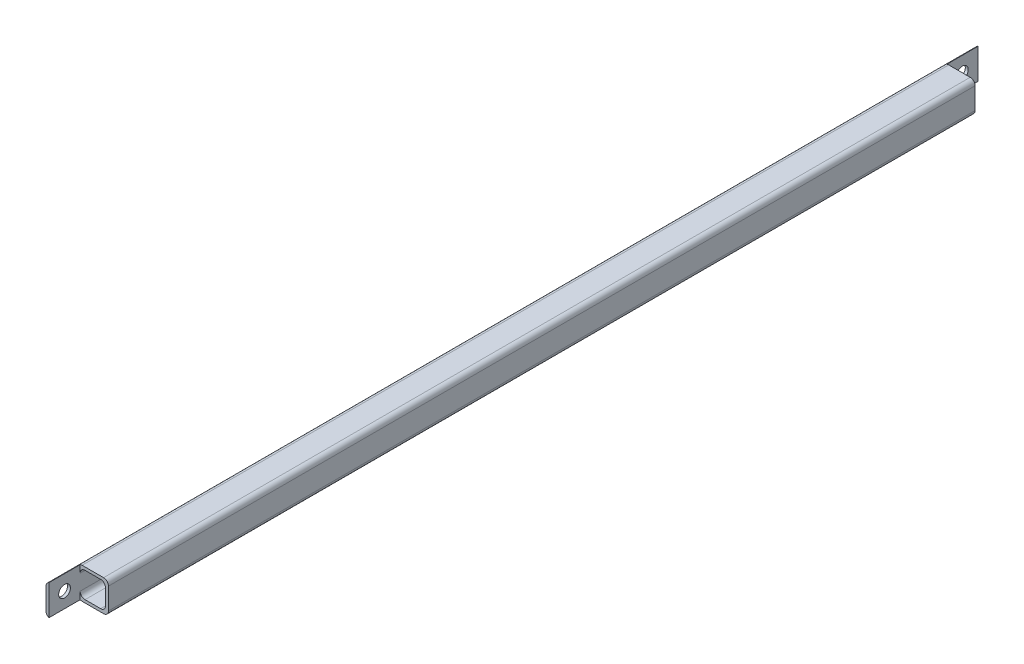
ISO-10303-21;
HEADER;
FILE_DESCRIPTION(('STEP AP214'),'2;1');
FILE_NAME('part.step','',(''),(''),'','','');
FILE_SCHEMA(('AUTOMOTIVE_DESIGN { 1 0 10303 214 1 1 1 1 }'));
ENDSEC;
DATA;
#1=APPLICATION_CONTEXT('core data for automotive mechanical design processes');
#2=APPLICATION_PROTOCOL_DEFINITION('international standard','automotive_design',2000,#1);
#3=PRODUCT_CONTEXT('',#1,'mechanical');
#4=PRODUCT('Part','Part','',(#3));
#5=PRODUCT_RELATED_PRODUCT_CATEGORY('part','',(#4));
#6=PRODUCT_DEFINITION_FORMATION('','',#4);
#7=PRODUCT_DEFINITION_CONTEXT('part definition',#1,'design');
#8=PRODUCT_DEFINITION('design','',#6,#7);
#9=PRODUCT_DEFINITION_SHAPE('','',#8);
#10=(LENGTH_UNIT() NAMED_UNIT(*) SI_UNIT(.MILLI.,.METRE.));
#11=(NAMED_UNIT(*) PLANE_ANGLE_UNIT() SI_UNIT($,.RADIAN.));
#12=(NAMED_UNIT(*) SI_UNIT($,.STERADIAN.) SOLID_ANGLE_UNIT());
#13=UNCERTAINTY_MEASURE_WITH_UNIT(LENGTH_MEASURE(1.E-05),#10,'distance_accuracy_value','');
#14=(GEOMETRIC_REPRESENTATION_CONTEXT(3) GLOBAL_UNCERTAINTY_ASSIGNED_CONTEXT((#13)) GLOBAL_UNIT_ASSIGNED_CONTEXT((#10,
#11,#12)) REPRESENTATION_CONTEXT('',''));
#15=CARTESIAN_POINT('',(0.,0.,0.));
#16=DIRECTION('',(0.,0.,1.));
#17=DIRECTION('',(1.,0.,0.));
#18=AXIS2_PLACEMENT_3D('',#15,#16,#17);
#19=CARTESIAN_POINT('',(-8.,5.5,238.));
#20=DIRECTION('',(1.,0.,0.));
#21=DIRECTION('',(0.,0.,-1.));
#22=AXIS2_PLACEMENT_3D('',#19,#20,#21);
#23=PLANE('',#22);
#24=DIRECTION('',(0.,-1.,0.));
#25=VECTOR('',#24,1.);
#26=CARTESIAN_POINT('',(-8.,5.5,-238.));
#27=LINE('',#26,#25);
#28=CARTESIAN_POINT('',(-8.,5.5,-238.));
#29=VERTEX_POINT('',#28);
#30=CARTESIAN_POINT('',(-8.,-5.5,-238.));
#31=VERTEX_POINT('',#30);
#32=EDGE_CURVE('E195',#29,#31,#27,.T.);
#33=ORIENTED_EDGE('',*,*,#32,.T.);
#34=DIRECTION('',(0.,0.,-1.));
#35=VECTOR('',#34,1.);
#36=CARTESIAN_POINT('',(-8.,-5.5,238.));
#37=LINE('',#36,#35);
#38=CARTESIAN_POINT('',(-8.,-5.5,238.));
#39=VERTEX_POINT('',#38);
#40=EDGE_CURVE('E212',#39,#31,#37,.T.);
#41=ORIENTED_EDGE('',*,*,#40,.F.);
#42=DIRECTION('',(0.,-1.,0.));
#43=VECTOR('',#42,1.);
#44=CARTESIAN_POINT('',(-8.,5.5,238.));
#45=LINE('',#44,#43);
#46=CARTESIAN_POINT('',(-8.,5.5,238.));
#47=VERTEX_POINT('',#46);
#48=EDGE_CURVE('E191',#47,#39,#45,.T.);
#49=ORIENTED_EDGE('',*,*,#48,.F.);
#50=DIRECTION('',(0.,0.,-1.));
#51=VECTOR('',#50,1.);
#52=CARTESIAN_POINT('',(-8.,5.5,238.));
#53=LINE('',#52,#51);
#54=EDGE_CURVE('E190',#47,#29,#53,.T.);
#55=ORIENTED_EDGE('',*,*,#54,.T.);
#56=EDGE_LOOP('',(#33,#41,#49,#55));
#57=FACE_BOUND('',#56,.T.);
#58=CARTESIAN_POINT('',(-8.,0.,-230.));
#59=DIRECTION('',(1.,0.,0.));
#60=DIRECTION('',(0.,0.,-1.));
#61=AXIS2_PLACEMENT_3D('',#58,#59,#60);
#62=CIRCLE('',#61,2.99999999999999);
#63=CARTESIAN_POINT('',(-8.,0.,-233.));
#64=VERTEX_POINT('',#63);
#65=EDGE_CURVE('E220',#64,#64,#62,.T.);
#66=ORIENTED_EDGE('',*,*,#65,.T.);
#67=EDGE_LOOP('',(#66));
#68=FACE_BOUND('',#67,.T.);
#69=CARTESIAN_POINT('',(-8.,0.,230.));
#70=DIRECTION('',(-1.,0.,0.));
#71=DIRECTION('',(0.,0.,1.));
#72=AXIS2_PLACEMENT_3D('',#69,#70,#71);
#73=CIRCLE('',#72,2.99999999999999);
#74=CARTESIAN_POINT('',(-8.,0.,233.));
#75=VERTEX_POINT('',#74);
#76=EDGE_CURVE('E230',#75,#75,#73,.T.);
#77=ORIENTED_EDGE('',*,*,#76,.F.);
#78=EDGE_LOOP('',(#77));
#79=FACE_BOUND('',#78,.T.);
#80=ADVANCED_FACE('F28',(#57,#68,#79),#23,.F.);
#81=CARTESIAN_POINT('',(-6.50000000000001,4.,238.));
#82=DIRECTION('',(1.,0.,0.));
#83=DIRECTION('',(0.,0.,-1.));
#84=AXIS2_PLACEMENT_3D('',#81,#82,#83);
#85=PLANE('',#84);
#86=DIRECTION('',(0.,0.,-1.));
#87=VECTOR('',#86,1.);
#88=CARTESIAN_POINT('',(-6.50000000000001,4.,238.));
#89=LINE('',#88,#87);
#90=CARTESIAN_POINT('',(-6.49999999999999,4.,222.));
#91=VERTEX_POINT('',#90);
#92=CARTESIAN_POINT('',(-6.50000000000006,4.,-222.));
#93=VERTEX_POINT('',#92);
#94=EDGE_CURVE('E324',#91,#93,#89,.T.);
#95=ORIENTED_EDGE('',*,*,#94,.F.);
#96=DIRECTION('',(0.,1.,0.));
#97=VECTOR('',#96,1.);
#98=CARTESIAN_POINT('',(-6.49999999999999,-8.,222.));
#99=LINE('',#98,#97);
#100=CARTESIAN_POINT('',(-6.49999999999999,7.79128784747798,222.));
#101=VERTEX_POINT('',#100);
#102=EDGE_CURVE('E182',#91,#101,#99,.T.);
#103=ORIENTED_EDGE('',*,*,#102,.T.);
#104=DIRECTION('',(0.,0.,-1.));
#105=VECTOR('',#104,1.);
#106=CARTESIAN_POINT('',(-6.49999999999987,7.79128784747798,238.));
#107=LINE('',#106,#105);
#108=CARTESIAN_POINT('',(-6.49999999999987,7.79128784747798,238.));
#109=VERTEX_POINT('',#108);
#110=EDGE_CURVE('E178',#101,#109,#107,.F.);
#111=ORIENTED_EDGE('',*,*,#110,.T.);
#112=DIRECTION('',(0.,-1.,0.));
#113=VECTOR('',#112,1.);
#114=CARTESIAN_POINT('',(-6.50000000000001,4.,238.));
#115=LINE('',#114,#113);
#116=CARTESIAN_POINT('',(-6.49999999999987,-7.79128784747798,238.));
#117=VERTEX_POINT('',#116);
#118=EDGE_CURVE('E45',#109,#117,#115,.T.);
#119=ORIENTED_EDGE('',*,*,#118,.T.);
#120=DIRECTION('',(0.,0.,-1.));
#121=VECTOR('',#120,1.);
#122=CARTESIAN_POINT('',(-6.49999999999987,-7.79128784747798,238.));
#123=LINE('',#122,#121);
#124=CARTESIAN_POINT('',(-6.49999999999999,-7.79128784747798,222.));
#125=VERTEX_POINT('',#124);
#126=EDGE_CURVE('E11',#125,#117,#123,.F.);
#127=ORIENTED_EDGE('',*,*,#126,.F.);
#128=CARTESIAN_POINT('',(-6.49999999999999,-4.,222.));
#129=VERTEX_POINT('',#128);
#130=EDGE_CURVE('E238',#125,#129,#99,.T.);
#131=ORIENTED_EDGE('',*,*,#130,.T.);
#132=DIRECTION('',(0.,0.,-1.));
#133=VECTOR('',#132,1.);
#134=CARTESIAN_POINT('',(-6.50000000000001,-4.,238.));
#135=LINE('',#134,#133);
#136=CARTESIAN_POINT('',(-6.50000000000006,-4.,-222.));
#137=VERTEX_POINT('',#136);
#138=EDGE_CURVE('E322',#129,#137,#135,.T.);
#139=ORIENTED_EDGE('',*,*,#138,.T.);
#140=DIRECTION('',(0.,1.,0.));
#141=VECTOR('',#140,1.);
#142=CARTESIAN_POINT('',(-6.50000000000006,-8.,-222.));
#143=LINE('',#142,#141);
#144=CARTESIAN_POINT('',(-6.50000000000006,-7.79128784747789,-222.));
#145=VERTEX_POINT('',#144);
#146=EDGE_CURVE('E274',#145,#137,#143,.T.);
#147=ORIENTED_EDGE('',*,*,#146,.F.);
#148=DIRECTION('',(0.,0.,-1.));
#149=VECTOR('',#148,1.);
#150=CARTESIAN_POINT('',(-6.5000000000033,-7.79128784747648,238.));
#151=LINE('',#150,#149);
#152=CARTESIAN_POINT('',(-6.49999999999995,-7.79128784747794,-238.));
#153=VERTEX_POINT('',#152);
#154=EDGE_CURVE('E305',#145,#153,#151,.T.);
#155=ORIENTED_EDGE('',*,*,#154,.T.);
#156=DIRECTION('',(0.,-1.,0.));
#157=VECTOR('',#156,1.);
#158=CARTESIAN_POINT('',(-6.50000000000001,4.,-238.));
#159=LINE('',#158,#157);
#160=CARTESIAN_POINT('',(-6.49999999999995,7.79128784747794,-238.));
#161=VERTEX_POINT('',#160);
#162=EDGE_CURVE('E174',#161,#153,#159,.T.);
#163=ORIENTED_EDGE('',*,*,#162,.F.);
#164=DIRECTION('',(0.,0.,-1.));
#165=VECTOR('',#164,1.);
#166=CARTESIAN_POINT('',(-6.5000000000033,7.79128784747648,238.));
#167=LINE('',#166,#165);
#168=CARTESIAN_POINT('',(-6.50000000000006,7.79128784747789,-222.));
#169=VERTEX_POINT('',#168);
#170=EDGE_CURVE('E308',#169,#161,#167,.T.);
#171=ORIENTED_EDGE('',*,*,#170,.F.);
#172=EDGE_CURVE('E269',#93,#169,#143,.T.);
#173=ORIENTED_EDGE('',*,*,#172,.F.);
#174=EDGE_LOOP('',(#95,#103,#111,#119,#127,#131,#139,#147,#155,#163,#171,#173));
#175=FACE_BOUND('',#174,.T.);
#176=CARTESIAN_POINT('',(-6.50000000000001,0.,-230.));
#177=DIRECTION('',(1.,0.,0.));
#178=DIRECTION('',(0.,0.,-1.));
#179=AXIS2_PLACEMENT_3D('',#176,#177,#178);
#180=CIRCLE('',#179,2.99999999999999);
#181=CARTESIAN_POINT('',(-6.50000000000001,0.,-233.));
#182=VERTEX_POINT('',#181);
#183=EDGE_CURVE('E217',#182,#182,#180,.T.);
#184=ORIENTED_EDGE('',*,*,#183,.F.);
#185=EDGE_LOOP('',(#184));
#186=FACE_BOUND('',#185,.T.);
#187=CARTESIAN_POINT('',(-6.50000000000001,0.,230.));
#188=DIRECTION('',(1.,0.,0.));
#189=DIRECTION('',(0.,0.,-1.));
#190=AXIS2_PLACEMENT_3D('',#187,#188,#189);
#191=CIRCLE('',#190,2.99999999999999);
#192=CARTESIAN_POINT('',(-6.50000000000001,0.,227.));
#193=VERTEX_POINT('',#192);
#194=EDGE_CURVE('E32',#193,#193,#191,.F.);
#195=ORIENTED_EDGE('',*,*,#194,.T.);
#196=EDGE_LOOP('',(#195));
#197=FACE_BOUND('',#196,.T.);
#198=ADVANCED_FACE('F180',(#175,#186,#197),#85,.T.);
#199=CARTESIAN_POINT('',(-5.5,5.5,238.));
#200=DIRECTION('',(0.,0.,1.));
#201=DIRECTION('',(1.,0.,0.));
#202=AXIS2_PLACEMENT_3D('',#199,#200,#201);
#203=PLANE('',#202);
#204=CARTESIAN_POINT('',(-5.5,-5.5,238.));
#205=DIRECTION('',(0.,0.,-1.));
#206=DIRECTION('',(-1.,0.,0.));
#207=AXIS2_PLACEMENT_3D('',#204,#205,#206);
#208=CIRCLE('',#207,2.5);
#209=EDGE_CURVE('E172',#117,#39,#208,.T.);
#210=ORIENTED_EDGE('',*,*,#209,.F.);
#211=ORIENTED_EDGE('',*,*,#118,.F.);
#212=CARTESIAN_POINT('',(-5.5,5.5,238.));
#213=DIRECTION('',(0.,0.,1.));
#214=DIRECTION('',(1.,0.,0.));
#215=AXIS2_PLACEMENT_3D('',#212,#213,#214);
#216=CIRCLE('',#215,2.5);
#217=EDGE_CURVE('E170',#109,#47,#216,.T.);
#218=ORIENTED_EDGE('',*,*,#217,.T.);
#219=ORIENTED_EDGE('',*,*,#48,.T.);
#220=EDGE_LOOP('',(#210,#211,#218,#219));
#221=FACE_BOUND('',#220,.T.);
#222=ADVANCED_FACE('F167',(#221),#203,.T.);
#223=CARTESIAN_POINT('',(5.49999999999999,-8.,238.));
#224=DIRECTION('',(0.,-1.,0.));
#225=DIRECTION('',(0.,0.,-1.));
#226=AXIS2_PLACEMENT_3D('',#223,#224,#225);
#227=PLANE('',#226);
#228=DIRECTION('',(-1.,0.,0.));
#229=VECTOR('',#228,1.);
#230=CARTESIAN_POINT('',(8.00000000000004,-8.,222.));
#231=LINE('',#230,#229);
#232=CARTESIAN_POINT('',(5.49999999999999,-8.,222.));
#233=VERTEX_POINT('',#232);
#234=CARTESIAN_POINT('',(-5.5,-8.,222.));
#235=VERTEX_POINT('',#234);
#236=EDGE_CURVE('E223',#233,#235,#231,.T.);
#237=ORIENTED_EDGE('',*,*,#236,.T.);
#238=DIRECTION('',(0.,0.,-1.));
#239=VECTOR('',#238,1.);
#240=CARTESIAN_POINT('',(-5.5,-8.,238.));
#241=LINE('',#240,#239);
#242=CARTESIAN_POINT('',(-5.5,-8.,-222.));
#243=VERTEX_POINT('',#242);
#244=EDGE_CURVE('E210',#235,#243,#241,.T.);
#245=ORIENTED_EDGE('',*,*,#244,.T.);
#246=DIRECTION('',(-1.,0.,0.));
#247=VECTOR('',#246,1.);
#248=CARTESIAN_POINT('',(7.99999999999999,-8.,-222.));
#249=LINE('',#248,#247);
#250=CARTESIAN_POINT('',(5.49999999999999,-8.,-222.));
#251=VERTEX_POINT('',#250);
#252=EDGE_CURVE('E266',#251,#243,#249,.T.);
#253=ORIENTED_EDGE('',*,*,#252,.F.);
#254=DIRECTION('',(0.,0.,-1.));
#255=VECTOR('',#254,1.);
#256=CARTESIAN_POINT('',(5.49999999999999,-8.,238.));
#257=LINE('',#256,#255);
#258=EDGE_CURVE('E208',#233,#251,#257,.T.);
#259=ORIENTED_EDGE('',*,*,#258,.F.);
#260=EDGE_LOOP('',(#237,#245,#253,#259));
#261=FACE_BOUND('',#260,.T.);
#262=ADVANCED_FACE('F399',(#261),#227,.T.);
#263=CARTESIAN_POINT('',(5.49999999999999,-5.5,238.));
#264=DIRECTION('',(0.,0.,-1.));
#265=DIRECTION('',(-1.,0.,0.));
#266=AXIS2_PLACEMENT_3D('',#263,#264,#265);
#267=CYLINDRICAL_SURFACE('',#266,2.5);
#268=CARTESIAN_POINT('',(5.49999999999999,-5.5,222.));
#269=DIRECTION('',(0.,0.,-1.));
#270=DIRECTION('',(-1.,0.,0.));
#271=AXIS2_PLACEMENT_3D('',#268,#269,#270);
#272=CIRCLE('',#271,2.5);
#273=CARTESIAN_POINT('',(8.00000000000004,-5.5,222.));
#274=VERTEX_POINT('',#273);
#275=EDGE_CURVE('E186',#233,#274,#272,.F.);
#276=ORIENTED_EDGE('',*,*,#275,.F.);
#277=ORIENTED_EDGE('',*,*,#258,.T.);
#278=CARTESIAN_POINT('',(5.49999999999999,-5.5,-222.));
#279=DIRECTION('',(0.,0.,-1.));
#280=DIRECTION('',(-1.,0.,0.));
#281=AXIS2_PLACEMENT_3D('',#278,#279,#280);
#282=CIRCLE('',#281,2.5);
#283=CARTESIAN_POINT('',(7.99999999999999,-5.5,-222.));
#284=VERTEX_POINT('',#283);
#285=EDGE_CURVE('E296',#251,#284,#282,.F.);
#286=ORIENTED_EDGE('',*,*,#285,.T.);
#287=DIRECTION('',(0.,0.,-1.));
#288=VECTOR('',#287,1.);
#289=CARTESIAN_POINT('',(7.99999999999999,-5.5,238.));
#290=LINE('',#289,#288);
#291=EDGE_CURVE('E206',#274,#284,#290,.T.);
#292=ORIENTED_EDGE('',*,*,#291,.F.);
#293=EDGE_LOOP('',(#276,#277,#286,#292));
#294=FACE_BOUND('',#293,.T.);
#295=ADVANCED_FACE('F396',(#294),#267,.T.);
#296=CARTESIAN_POINT('',(7.99999999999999,-5.5,238.));
#297=DIRECTION('',(-1.,0.,0.));
#298=DIRECTION('',(0.,0.,1.));
#299=AXIS2_PLACEMENT_3D('',#296,#297,#298);
#300=PLANE('',#299);
#301=DIRECTION('',(0.,0.,-1.));
#302=VECTOR('',#301,1.);
#303=CARTESIAN_POINT('',(7.99999999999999,5.5,238.));
#304=LINE('',#303,#302);
#305=CARTESIAN_POINT('',(8.00000000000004,5.5,222.));
#306=VERTEX_POINT('',#305);
#307=CARTESIAN_POINT('',(7.99999999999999,5.5,-222.));
#308=VERTEX_POINT('',#307);
#309=EDGE_CURVE('E204',#306,#308,#304,.T.);
#310=ORIENTED_EDGE('',*,*,#309,.F.);
#311=DIRECTION('',(0.,1.,0.));
#312=VECTOR('',#311,1.);
#313=CARTESIAN_POINT('',(8.00000000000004,-8.,222.));
#314=LINE('',#313,#312);
#315=EDGE_CURVE('E235',#274,#306,#314,.T.);
#316=ORIENTED_EDGE('',*,*,#315,.F.);
#317=ORIENTED_EDGE('',*,*,#291,.T.);
#318=DIRECTION('',(0.,1.,0.));
#319=VECTOR('',#318,1.);
#320=CARTESIAN_POINT('',(7.99999999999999,-8.,-222.));
#321=LINE('',#320,#319);
#322=EDGE_CURVE('E270',#284,#308,#321,.T.);
#323=ORIENTED_EDGE('',*,*,#322,.T.);
#324=EDGE_LOOP('',(#310,#316,#317,#323));
#325=FACE_BOUND('',#324,.T.);
#326=ADVANCED_FACE('F390',(#325),#300,.F.);
#327=CARTESIAN_POINT('',(5.49999999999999,5.5,238.));
#328=DIRECTION('',(0.,0.,-1.));
#329=DIRECTION('',(-1.,0.,0.));
#330=AXIS2_PLACEMENT_3D('',#327,#328,#329);
#331=CYLINDRICAL_SURFACE('',#330,2.5);
#332=DIRECTION('',(0.,0.,-1.));
#333=VECTOR('',#332,1.);
#334=CARTESIAN_POINT('',(5.49999999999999,8.,238.));
#335=LINE('',#334,#333);
#336=CARTESIAN_POINT('',(5.49999999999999,8.,222.));
#337=VERTEX_POINT('',#336);
#338=CARTESIAN_POINT('',(5.49999999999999,8.,-222.));
#339=VERTEX_POINT('',#338);
#340=EDGE_CURVE('E202',#337,#339,#335,.T.);
#341=ORIENTED_EDGE('',*,*,#340,.F.);
#342=CARTESIAN_POINT('',(5.49999999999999,5.5,222.));
#343=DIRECTION('',(0.,0.,-1.));
#344=DIRECTION('',(-1.,0.,0.));
#345=AXIS2_PLACEMENT_3D('',#342,#343,#344);
#346=CIRCLE('',#345,2.5);
#347=EDGE_CURVE('E260',#337,#306,#346,.T.);
#348=ORIENTED_EDGE('',*,*,#347,.T.);
#349=ORIENTED_EDGE('',*,*,#309,.T.);
#350=CARTESIAN_POINT('',(5.49999999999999,5.5,-222.));
#351=DIRECTION('',(0.,0.,-1.));
#352=DIRECTION('',(-1.,0.,0.));
#353=AXIS2_PLACEMENT_3D('',#350,#351,#352);
#354=CIRCLE('',#353,2.5);
#355=EDGE_CURVE('E293',#339,#308,#354,.T.);
#356=ORIENTED_EDGE('',*,*,#355,.F.);
#357=EDGE_LOOP('',(#341,#348,#349,#356));
#358=FACE_BOUND('',#357,.T.);
#359=ADVANCED_FACE('F386',(#358),#331,.T.);
#360=CARTESIAN_POINT('',(-5.5,8.,238.));
#361=DIRECTION('',(0.,1.,0.));
#362=DIRECTION('',(0.,0.,1.));
#363=AXIS2_PLACEMENT_3D('',#360,#361,#362);
#364=PLANE('',#363);
#365=DIRECTION('',(-1.,0.,0.));
#366=VECTOR('',#365,1.);
#367=CARTESIAN_POINT('',(8.00000000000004,8.,222.));
#368=LINE('',#367,#366);
#369=CARTESIAN_POINT('',(-5.5,8.,222.));
#370=VERTEX_POINT('',#369);
#371=EDGE_CURVE('E219',#337,#370,#368,.T.);
#372=ORIENTED_EDGE('',*,*,#371,.F.);
#373=ORIENTED_EDGE('',*,*,#340,.T.);
#374=DIRECTION('',(-1.,0.,0.));
#375=VECTOR('',#374,1.);
#376=CARTESIAN_POINT('',(7.99999999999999,8.,-222.));
#377=LINE('',#376,#375);
#378=CARTESIAN_POINT('',(-5.5,8.,-222.));
#379=VERTEX_POINT('',#378);
#380=EDGE_CURVE('E185',#339,#379,#377,.T.);
#381=ORIENTED_EDGE('',*,*,#380,.T.);
#382=DIRECTION('',(0.,0.,-1.));
#383=VECTOR('',#382,1.);
#384=CARTESIAN_POINT('',(-5.5,8.,238.));
#385=LINE('',#384,#383);
#386=EDGE_CURVE('E200',#370,#379,#385,.T.);
#387=ORIENTED_EDGE('',*,*,#386,.F.);
#388=EDGE_LOOP('',(#372,#373,#381,#387));
#389=FACE_BOUND('',#388,.T.);
#390=ADVANCED_FACE('F381',(#389),#364,.T.);
#391=CARTESIAN_POINT('',(-4.00000000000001,4.,238.));
#392=DIRECTION('',(0.,0.,-1.));
#393=DIRECTION('',(-1.,0.,0.));
#394=AXIS2_PLACEMENT_3D('',#391,#392,#393);
#395=CYLINDRICAL_SURFACE('',#394,2.5);
#396=CARTESIAN_POINT('',(-4.00000000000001,4.,222.));
#397=DIRECTION('',(0.,0.,-1.));
#398=DIRECTION('',(-1.,0.,0.));
#399=AXIS2_PLACEMENT_3D('',#396,#397,#398);
#400=CIRCLE('',#399,2.5);
#401=CARTESIAN_POINT('',(-4.00000000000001,6.5,222.));
#402=VERTEX_POINT('',#401);
#403=EDGE_CURVE('E258',#91,#402,#400,.T.);
#404=ORIENTED_EDGE('',*,*,#403,.F.);
#405=ORIENTED_EDGE('',*,*,#94,.T.);
#406=CARTESIAN_POINT('',(-4.00000000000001,4.,-222.));
#407=DIRECTION('',(0.,0.,-1.));
#408=DIRECTION('',(-1.,0.,0.));
#409=AXIS2_PLACEMENT_3D('',#406,#407,#408);
#410=CIRCLE('',#409,2.5);
#411=CARTESIAN_POINT('',(-4.00000000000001,6.5,-222.));
#412=VERTEX_POINT('',#411);
#413=EDGE_CURVE('E290',#93,#412,#410,.T.);
#414=ORIENTED_EDGE('',*,*,#413,.T.);
#415=DIRECTION('',(0.,0.,-1.));
#416=VECTOR('',#415,1.);
#417=CARTESIAN_POINT('',(-4.00000000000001,6.5,238.));
#418=LINE('',#417,#416);
#419=EDGE_CURVE('E173',#402,#412,#418,.T.);
#420=ORIENTED_EDGE('',*,*,#419,.F.);
#421=EDGE_LOOP('',(#404,#405,#414,#420));
#422=FACE_BOUND('',#421,.T.);
#423=ADVANCED_FACE('F375',(#422),#395,.F.);
#424=CARTESIAN_POINT('',(-4.00000000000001,-4.,238.));
#425=DIRECTION('',(0.,0.,-1.));
#426=DIRECTION('',(-1.,0.,0.));
#427=AXIS2_PLACEMENT_3D('',#424,#425,#426);
#428=CYLINDRICAL_SURFACE('',#427,2.5);
#429=CARTESIAN_POINT('',(-4.00000000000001,-4.,222.));
#430=DIRECTION('',(0.,0.,-1.));
#431=DIRECTION('',(-1.,0.,0.));
#432=AXIS2_PLACEMENT_3D('',#429,#430,#431);
#433=CIRCLE('',#432,2.5);
#434=CARTESIAN_POINT('',(-4.00000000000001,-6.5,222.));
#435=VERTEX_POINT('',#434);
#436=EDGE_CURVE('E256',#435,#129,#433,.T.);
#437=ORIENTED_EDGE('',*,*,#436,.F.);
#438=DIRECTION('',(0.,0.,-1.));
#439=VECTOR('',#438,1.);
#440=CARTESIAN_POINT('',(-4.00000000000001,-6.5,238.));
#441=LINE('',#440,#439);
#442=CARTESIAN_POINT('',(-4.00000000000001,-6.5,-222.));
#443=VERTEX_POINT('',#442);
#444=EDGE_CURVE('E320',#435,#443,#441,.T.);
#445=ORIENTED_EDGE('',*,*,#444,.T.);
#446=CARTESIAN_POINT('',(-4.00000000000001,-4.,-222.));
#447=DIRECTION('',(0.,0.,-1.));
#448=DIRECTION('',(-1.,0.,0.));
#449=AXIS2_PLACEMENT_3D('',#446,#447,#448);
#450=CIRCLE('',#449,2.5);
#451=EDGE_CURVE('E287',#443,#137,#450,.T.);
#452=ORIENTED_EDGE('',*,*,#451,.T.);
#453=ORIENTED_EDGE('',*,*,#138,.F.);
#454=EDGE_LOOP('',(#437,#445,#452,#453));
#455=FACE_BOUND('',#454,.T.);
#456=ADVANCED_FACE('F348',(#455),#428,.F.);
#457=CARTESIAN_POINT('',(3.99999999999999,-6.5,238.));
#458=DIRECTION('',(0.,-1.,0.));
#459=DIRECTION('',(0.,0.,-1.));
#460=AXIS2_PLACEMENT_3D('',#457,#458,#459);
#461=PLANE('',#460);
#462=ORIENTED_EDGE('',*,*,#444,.F.);
#463=DIRECTION('',(1.,0.,0.));
#464=VECTOR('',#463,1.);
#465=CARTESIAN_POINT('',(3.99999999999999,-6.5,222.));
#466=LINE('',#465,#464);
#467=CARTESIAN_POINT('',(3.99999999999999,-6.5,222.));
#468=VERTEX_POINT('',#467);
#469=EDGE_CURVE('E253',#435,#468,#466,.T.);
#470=ORIENTED_EDGE('',*,*,#469,.T.);
#471=DIRECTION('',(0.,0.,-1.));
#472=VECTOR('',#471,1.);
#473=CARTESIAN_POINT('',(3.99999999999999,-6.5,238.));
#474=LINE('',#473,#472);
#475=CARTESIAN_POINT('',(3.99999999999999,-6.5,-222.));
#476=VERTEX_POINT('',#475);
#477=EDGE_CURVE('E318',#468,#476,#474,.T.);
#478=ORIENTED_EDGE('',*,*,#477,.T.);
#479=DIRECTION('',(1.,0.,0.));
#480=VECTOR('',#479,1.);
#481=CARTESIAN_POINT('',(3.99999999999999,-6.5,-222.));
#482=LINE('',#481,#480);
#483=EDGE_CURVE('E284',#443,#476,#482,.T.);
#484=ORIENTED_EDGE('',*,*,#483,.F.);
#485=EDGE_LOOP('',(#462,#470,#478,#484));
#486=FACE_BOUND('',#485,.T.);
#487=ADVANCED_FACE('F352',(#486),#461,.F.);
#488=CARTESIAN_POINT('',(3.99999999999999,-4.,238.));
#489=DIRECTION('',(0.,0.,-1.));
#490=DIRECTION('',(-1.,0.,0.));
#491=AXIS2_PLACEMENT_3D('',#488,#489,#490);
#492=CYLINDRICAL_SURFACE('',#491,2.5);
#493=ORIENTED_EDGE('',*,*,#477,.F.);
#494=CARTESIAN_POINT('',(3.99999999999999,-4.,222.));
#495=DIRECTION('',(0.,0.,-1.));
#496=DIRECTION('',(-1.,0.,0.));
#497=AXIS2_PLACEMENT_3D('',#494,#495,#496);
#498=CIRCLE('',#497,2.5);
#499=CARTESIAN_POINT('',(6.49999999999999,-4.,222.));
#500=VERTEX_POINT('',#499);
#501=EDGE_CURVE('E250',#468,#500,#498,.F.);
#502=ORIENTED_EDGE('',*,*,#501,.T.);
#503=DIRECTION('',(0.,0.,-1.));
#504=VECTOR('',#503,1.);
#505=CARTESIAN_POINT('',(6.49999999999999,-4.,238.));
#506=LINE('',#505,#504);
#507=CARTESIAN_POINT('',(6.49999999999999,-4.,-222.));
#508=VERTEX_POINT('',#507);
#509=EDGE_CURVE('E316',#500,#508,#506,.T.);
#510=ORIENTED_EDGE('',*,*,#509,.T.);
#511=CARTESIAN_POINT('',(3.99999999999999,-4.,-222.));
#512=DIRECTION('',(0.,0.,-1.));
#513=DIRECTION('',(-1.,0.,0.));
#514=AXIS2_PLACEMENT_3D('',#511,#512,#513);
#515=CIRCLE('',#514,2.5);
#516=EDGE_CURVE('E281',#476,#508,#515,.F.);
#517=ORIENTED_EDGE('',*,*,#516,.F.);
#518=EDGE_LOOP('',(#493,#502,#510,#517));
#519=FACE_BOUND('',#518,.T.);
#520=ADVANCED_FACE('F360',(#519),#492,.F.);
#521=CARTESIAN_POINT('',(6.49999999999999,-4.,238.));
#522=DIRECTION('',(-1.,0.,0.));
#523=DIRECTION('',(0.,0.,1.));
#524=AXIS2_PLACEMENT_3D('',#521,#522,#523);
#525=PLANE('',#524);
#526=DIRECTION('',(0.,-1.,0.));
#527=VECTOR('',#526,1.);
#528=CARTESIAN_POINT('',(6.49999999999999,-4.,222.));
#529=LINE('',#528,#527);
#530=CARTESIAN_POINT('',(6.49999999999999,4.,222.));
#531=VERTEX_POINT('',#530);
#532=EDGE_CURVE('E248',#531,#500,#529,.T.);
#533=ORIENTED_EDGE('',*,*,#532,.F.);
#534=DIRECTION('',(0.,0.,-1.));
#535=VECTOR('',#534,1.);
#536=CARTESIAN_POINT('',(6.49999999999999,4.,238.));
#537=LINE('',#536,#535);
#538=CARTESIAN_POINT('',(6.49999999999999,4.,-222.));
#539=VERTEX_POINT('',#538);
#540=EDGE_CURVE('E314',#531,#539,#537,.T.);
#541=ORIENTED_EDGE('',*,*,#540,.T.);
#542=DIRECTION('',(0.,-1.,0.));
#543=VECTOR('',#542,1.);
#544=CARTESIAN_POINT('',(6.49999999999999,-4.,-222.));
#545=LINE('',#544,#543);
#546=EDGE_CURVE('E278',#539,#508,#545,.T.);
#547=ORIENTED_EDGE('',*,*,#546,.T.);
#548=ORIENTED_EDGE('',*,*,#509,.F.);
#549=EDGE_LOOP('',(#533,#541,#547,#548));
#550=FACE_BOUND('',#549,.T.);
#551=ADVANCED_FACE('F364',(#550),#525,.T.);
#552=CARTESIAN_POINT('',(3.99999999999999,4.,238.));
#553=DIRECTION('',(0.,0.,-1.));
#554=DIRECTION('',(-1.,0.,0.));
#555=AXIS2_PLACEMENT_3D('',#552,#553,#554);
#556=CYLINDRICAL_SURFACE('',#555,2.5);
#557=CARTESIAN_POINT('',(3.99999999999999,4.,222.));
#558=DIRECTION('',(0.,0.,-1.));
#559=DIRECTION('',(-1.,0.,0.));
#560=AXIS2_PLACEMENT_3D('',#557,#558,#559);
#561=CIRCLE('',#560,2.5);
#562=CARTESIAN_POINT('',(3.99999999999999,6.5,222.));
#563=VERTEX_POINT('',#562);
#564=EDGE_CURVE('E246',#563,#531,#561,.T.);
#565=ORIENTED_EDGE('',*,*,#564,.F.);
#566=DIRECTION('',(0.,0.,-1.));
#567=VECTOR('',#566,1.);
#568=CARTESIAN_POINT('',(3.99999999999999,6.5,238.));
#569=LINE('',#568,#567);
#570=CARTESIAN_POINT('',(3.99999999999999,6.5,-222.));
#571=VERTEX_POINT('',#570);
#572=EDGE_CURVE('E52',#563,#571,#569,.T.);
#573=ORIENTED_EDGE('',*,*,#572,.T.);
#574=CARTESIAN_POINT('',(3.99999999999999,4.,-222.));
#575=DIRECTION('',(0.,0.,-1.));
#576=DIRECTION('',(-1.,0.,0.));
#577=AXIS2_PLACEMENT_3D('',#574,#575,#576);
#578=CIRCLE('',#577,2.5);
#579=EDGE_CURVE('E273',#571,#539,#578,.T.);
#580=ORIENTED_EDGE('',*,*,#579,.T.);
#581=ORIENTED_EDGE('',*,*,#540,.F.);
#582=EDGE_LOOP('',(#565,#573,#580,#581));
#583=FACE_BOUND('',#582,.T.);
#584=ADVANCED_FACE('F367',(#583),#556,.F.);
#585=CARTESIAN_POINT('',(-4.00000000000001,6.5,238.));
#586=DIRECTION('',(0.,1.,0.));
#587=DIRECTION('',(0.,0.,1.));
#588=AXIS2_PLACEMENT_3D('',#585,#586,#587);
#589=PLANE('',#588);
#590=ORIENTED_EDGE('',*,*,#572,.F.);
#591=DIRECTION('',(-1.,0.,0.));
#592=VECTOR('',#591,1.);
#593=CARTESIAN_POINT('',(-4.00000000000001,6.5,222.));
#594=LINE('',#593,#592);
#595=EDGE_CURVE('E243',#563,#402,#594,.T.);
#596=ORIENTED_EDGE('',*,*,#595,.T.);
#597=ORIENTED_EDGE('',*,*,#419,.T.);
#598=DIRECTION('',(-1.,0.,0.));
#599=VECTOR('',#598,1.);
#600=CARTESIAN_POINT('',(-4.00000000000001,6.5,-222.));
#601=LINE('',#600,#599);
#602=EDGE_CURVE('E37',#571,#412,#601,.T.);
#603=ORIENTED_EDGE('',*,*,#602,.F.);
#604=EDGE_LOOP('',(#590,#596,#597,#603));
#605=FACE_BOUND('',#604,.T.);
#606=ADVANCED_FACE('F369',(#605),#589,.F.);
#607=CARTESIAN_POINT('',(-5.5,5.5,-238.));
#608=DIRECTION('',(0.,0.,1.));
#609=DIRECTION('',(1.,0.,0.));
#610=AXIS2_PLACEMENT_3D('',#607,#608,#609);
#611=PLANE('',#610);
#612=CARTESIAN_POINT('',(-5.5,5.5,-238.));
#613=DIRECTION('',(0.,0.,1.));
#614=DIRECTION('',(1.,0.,0.));
#615=AXIS2_PLACEMENT_3D('',#612,#613,#614);
#616=CIRCLE('',#615,2.5);
#617=EDGE_CURVE('E326',#161,#29,#616,.T.);
#618=ORIENTED_EDGE('',*,*,#617,.F.);
#619=ORIENTED_EDGE('',*,*,#162,.T.);
#620=CARTESIAN_POINT('',(-5.5,-5.5,-238.));
#621=DIRECTION('',(0.,0.,-1.));
#622=DIRECTION('',(-1.,0.,0.));
#623=AXIS2_PLACEMENT_3D('',#620,#621,#622);
#624=CIRCLE('',#623,2.5);
#625=EDGE_CURVE('E192',#153,#31,#624,.T.);
#626=ORIENTED_EDGE('',*,*,#625,.T.);
#627=ORIENTED_EDGE('',*,*,#32,.F.);
#628=EDGE_LOOP('',(#618,#619,#626,#627));
#629=FACE_BOUND('',#628,.T.);
#630=ADVANCED_FACE('F333',(#629),#611,.F.);
#631=CARTESIAN_POINT('',(-5.5,5.5,238.));
#632=DIRECTION('',(0.,0.,-1.));
#633=DIRECTION('',(-1.,0.,0.));
#634=AXIS2_PLACEMENT_3D('',#631,#632,#633);
#635=CYLINDRICAL_SURFACE('',#634,2.5);
#636=ORIENTED_EDGE('',*,*,#110,.F.);
#637=CARTESIAN_POINT('',(-5.5,5.5,222.));
#638=DIRECTION('',(0.,0.,-1.));
#639=DIRECTION('',(-1.,0.,0.));
#640=AXIS2_PLACEMENT_3D('',#637,#638,#639);
#641=CIRCLE('',#640,2.5);
#642=EDGE_CURVE('E241',#101,#370,#641,.T.);
#643=ORIENTED_EDGE('',*,*,#642,.T.);
#644=ORIENTED_EDGE('',*,*,#386,.T.);
#645=CARTESIAN_POINT('',(-5.5,5.5,-222.));
#646=DIRECTION('',(0.,0.,-1.));
#647=DIRECTION('',(-1.,0.,0.));
#648=AXIS2_PLACEMENT_3D('',#645,#646,#647);
#649=CIRCLE('',#648,2.5);
#650=EDGE_CURVE('E302',#169,#379,#649,.T.);
#651=ORIENTED_EDGE('',*,*,#650,.F.);
#652=ORIENTED_EDGE('',*,*,#170,.T.);
#653=ORIENTED_EDGE('',*,*,#617,.T.);
#654=ORIENTED_EDGE('',*,*,#54,.F.);
#655=ORIENTED_EDGE('',*,*,#217,.F.);
#656=EDGE_LOOP('',(#636,#643,#644,#651,#652,#653,#654,#655));
#657=FACE_BOUND('',#656,.T.);
#658=ADVANCED_FACE('F30',(#657),#635,.T.);
#659=CARTESIAN_POINT('',(-5.5,-5.5,238.));
#660=DIRECTION('',(0.,0.,-1.));
#661=DIRECTION('',(-1.,0.,0.));
#662=AXIS2_PLACEMENT_3D('',#659,#660,#661);
#663=CYLINDRICAL_SURFACE('',#662,2.5);
#664=CARTESIAN_POINT('',(-5.5,-5.5,222.));
#665=DIRECTION('',(0.,0.,-1.));
#666=DIRECTION('',(-1.,0.,0.));
#667=AXIS2_PLACEMENT_3D('',#664,#665,#666);
#668=CIRCLE('',#667,2.5);
#669=EDGE_CURVE('E237',#125,#235,#668,.F.);
#670=ORIENTED_EDGE('',*,*,#669,.F.);
#671=ORIENTED_EDGE('',*,*,#126,.T.);
#672=ORIENTED_EDGE('',*,*,#209,.T.);
#673=ORIENTED_EDGE('',*,*,#40,.T.);
#674=ORIENTED_EDGE('',*,*,#625,.F.);
#675=ORIENTED_EDGE('',*,*,#154,.F.);
#676=CARTESIAN_POINT('',(-5.5,-5.5,-222.));
#677=DIRECTION('',(0.,0.,-1.));
#678=DIRECTION('',(-1.,0.,0.));
#679=AXIS2_PLACEMENT_3D('',#676,#677,#678);
#680=CIRCLE('',#679,2.5);
#681=EDGE_CURVE('E299',#145,#243,#680,.F.);
#682=ORIENTED_EDGE('',*,*,#681,.T.);
#683=ORIENTED_EDGE('',*,*,#244,.F.);
#684=EDGE_LOOP('',(#670,#671,#672,#673,#674,#675,#682,#683));
#685=FACE_BOUND('',#684,.T.);
#686=ADVANCED_FACE('F338',(#685),#663,.T.);
#687=CARTESIAN_POINT('',(7.99999999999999,-8.,-222.));
#688=DIRECTION('',(0.,0.,-1.));
#689=DIRECTION('',(-1.,0.,0.));
#690=AXIS2_PLACEMENT_3D('',#687,#688,#689);
#691=PLANE('',#690);
#692=ORIENTED_EDGE('',*,*,#650,.T.);
#693=ORIENTED_EDGE('',*,*,#380,.F.);
#694=ORIENTED_EDGE('',*,*,#355,.T.);
#695=ORIENTED_EDGE('',*,*,#322,.F.);
#696=ORIENTED_EDGE('',*,*,#285,.F.);
#697=ORIENTED_EDGE('',*,*,#252,.T.);
#698=ORIENTED_EDGE('',*,*,#681,.F.);
#699=ORIENTED_EDGE('',*,*,#146,.T.);
#700=ORIENTED_EDGE('',*,*,#451,.F.);
#701=ORIENTED_EDGE('',*,*,#483,.T.);
#702=ORIENTED_EDGE('',*,*,#516,.T.);
#703=ORIENTED_EDGE('',*,*,#546,.F.);
#704=ORIENTED_EDGE('',*,*,#579,.F.);
#705=ORIENTED_EDGE('',*,*,#602,.T.);
#706=ORIENTED_EDGE('',*,*,#413,.F.);
#707=ORIENTED_EDGE('',*,*,#172,.T.);
#708=EDGE_LOOP('',(#692,#693,#694,#695,#696,#697,#698,#699,#700,#701,#702,#703,#704,#705,#706,#707));
#709=FACE_BOUND('',#708,.T.);
#710=ADVANCED_FACE('F356',(#709),#691,.T.);
#711=CARTESIAN_POINT('',(8.00000000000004,-8.,222.));
#712=DIRECTION('',(0.,0.,-1.));
#713=DIRECTION('',(-1.,0.,0.));
#714=AXIS2_PLACEMENT_3D('',#711,#712,#713);
#715=PLANE('',#714);
#716=ORIENTED_EDGE('',*,*,#275,.T.);
#717=ORIENTED_EDGE('',*,*,#315,.T.);
#718=ORIENTED_EDGE('',*,*,#347,.F.);
#719=ORIENTED_EDGE('',*,*,#371,.T.);
#720=ORIENTED_EDGE('',*,*,#642,.F.);
#721=ORIENTED_EDGE('',*,*,#102,.F.);
#722=ORIENTED_EDGE('',*,*,#403,.T.);
#723=ORIENTED_EDGE('',*,*,#595,.F.);
#724=ORIENTED_EDGE('',*,*,#564,.T.);
#725=ORIENTED_EDGE('',*,*,#532,.T.);
#726=ORIENTED_EDGE('',*,*,#501,.F.);
#727=ORIENTED_EDGE('',*,*,#469,.F.);
#728=ORIENTED_EDGE('',*,*,#436,.T.);
#729=ORIENTED_EDGE('',*,*,#130,.F.);
#730=ORIENTED_EDGE('',*,*,#669,.T.);
#731=ORIENTED_EDGE('',*,*,#236,.F.);
#732=EDGE_LOOP('',(#716,#717,#718,#719,#720,#721,#722,#723,#724,#725,#726,#727,#728,#729,#730,#731));
#733=FACE_BOUND('',#732,.T.);
#734=ADVANCED_FACE('F344',(#733),#715,.F.);
#735=CARTESIAN_POINT('',(-8.,0.,-230.));
#736=DIRECTION('',(1.,0.,0.));
#737=DIRECTION('',(0.,0.,-1.));
#738=AXIS2_PLACEMENT_3D('',#735,#736,#737);
#739=CYLINDRICAL_SURFACE('',#738,2.99999999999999);
#740=ORIENTED_EDGE('',*,*,#183,.T.);
#741=EDGE_LOOP('',(#740));
#742=FACE_BOUND('',#741,.T.);
#743=ORIENTED_EDGE('',*,*,#65,.F.);
#744=EDGE_LOOP('',(#743));
#745=FACE_BOUND('',#744,.T.);
#746=ADVANCED_FACE('F498',(#742,#745),#739,.F.);
#747=CARTESIAN_POINT('',(-8.,0.,230.));
#748=DIRECTION('',(1.,0.,0.));
#749=DIRECTION('',(0.,0.,-1.));
#750=AXIS2_PLACEMENT_3D('',#747,#748,#749);
#751=CYLINDRICAL_SURFACE('',#750,2.99999999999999);
#752=ORIENTED_EDGE('',*,*,#194,.F.);
#753=EDGE_LOOP('',(#752));
#754=FACE_BOUND('',#753,.T.);
#755=ORIENTED_EDGE('',*,*,#76,.T.);
#756=EDGE_LOOP('',(#755));
#757=FACE_BOUND('',#756,.T.);
#758=ADVANCED_FACE('F501',(#754,#757),#751,.F.);
#759=CLOSED_SHELL('',(#80,#198,#222,#262,#295,#326,#359,#390,#423,#456,#487,#520,#551,#584,#606,
#630,#658,#686,#710,#734,#746,#758));
#760=MANIFOLD_SOLID_BREP('B2',#759);
#761=ADVANCED_BREP_SHAPE_REPRESENTATION('',(#18,#760),#14);
#762=SHAPE_DEFINITION_REPRESENTATION(#9,#761);
ENDSEC;
END-ISO-10303-21;
